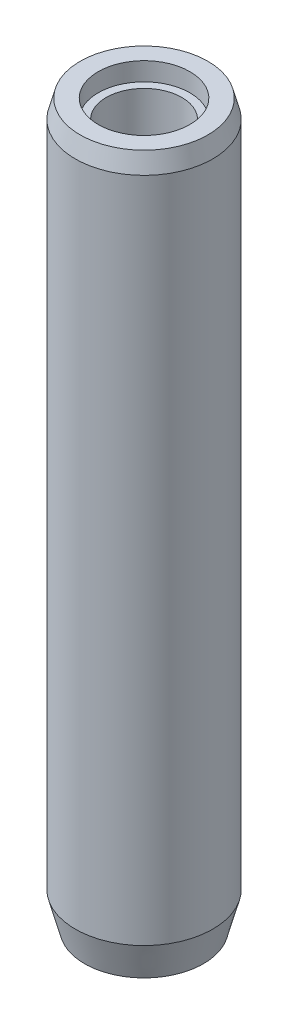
from build123d import *


with BuildPart() as part:
    # Sketch1 → Revolve1 (revolve)
    with BuildSketch(Plane.XY, mode=Mode.PRIVATE) as revolve1_sk:
        with BuildLine():
            Line((0, 0), (0, 20.508579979))
            Line((0, 20.508579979), (1.65, 21.5))
            Line((1.65, 21.5), (1.65, 31.2))
            Line((1.65, 31.2), (2, 31.2))
            Line((2, 31.2), (2, 32))
            Line((2, 32), (2.785640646, 32))
            Line((2.785640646, 32), (3, 31.2))
            Line((3, 31.2), (3, 2.1))
            Line((3, 2.1), (2.595515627, 0.590443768))
            ThreePointArc((2.595515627, 0.590443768), (1.33091371, 0.149472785), (0, 0))
        make_face()
    revolve(revolve1_sk.sketch.rotate(Axis((0, 0, 0), (0, 1, 0)), 90), axis=Axis((0, 0, 0), (0, 1, 0)))


solid = part.part
